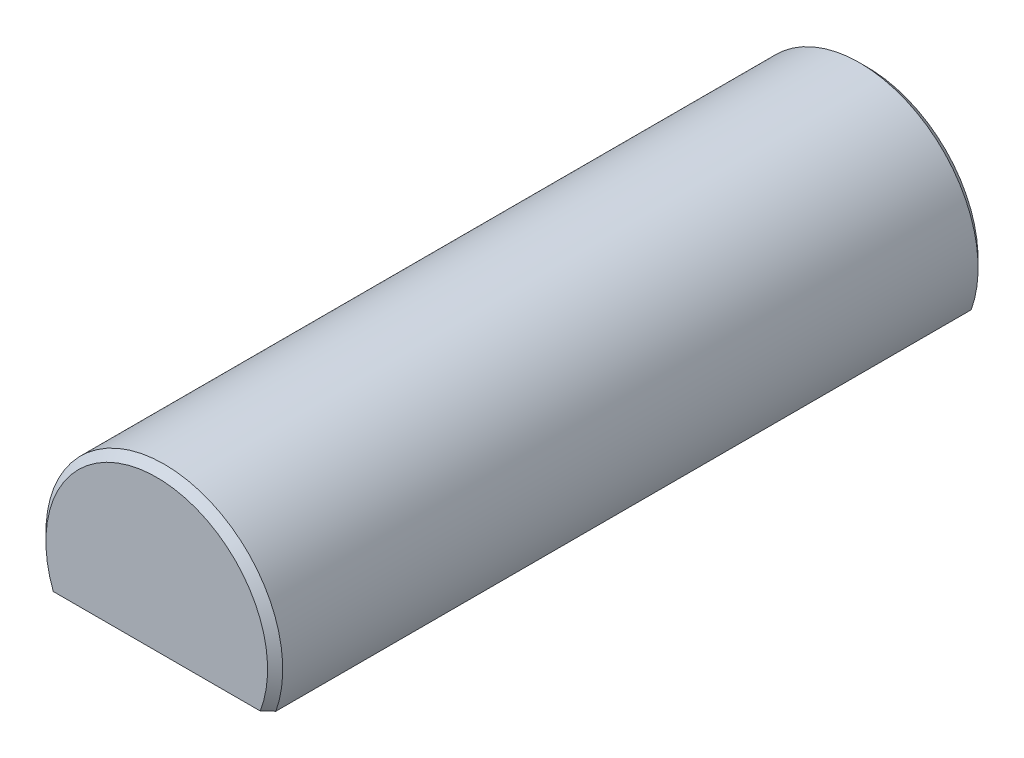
ISO-10303-21;
HEADER;
FILE_DESCRIPTION(('STEP AP214'),'2;1');
FILE_NAME('part.step','',(''),(''),'','','');
FILE_SCHEMA(('AUTOMOTIVE_DESIGN { 1 0 10303 214 1 1 1 1 }'));
ENDSEC;
DATA;
#1=APPLICATION_CONTEXT('core data for automotive mechanical design processes');
#2=APPLICATION_PROTOCOL_DEFINITION('international standard','automotive_design',2000,#1);
#3=PRODUCT_CONTEXT('',#1,'mechanical');
#4=PRODUCT('Part','Part','',(#3));
#5=PRODUCT_RELATED_PRODUCT_CATEGORY('part','',(#4));
#6=PRODUCT_DEFINITION_FORMATION('','',#4);
#7=PRODUCT_DEFINITION_CONTEXT('part definition',#1,'design');
#8=PRODUCT_DEFINITION('design','',#6,#7);
#9=PRODUCT_DEFINITION_SHAPE('','',#8);
#10=(LENGTH_UNIT() NAMED_UNIT(*) SI_UNIT(.MILLI.,.METRE.));
#11=(NAMED_UNIT(*) PLANE_ANGLE_UNIT() SI_UNIT($,.RADIAN.));
#12=(NAMED_UNIT(*) SI_UNIT($,.STERADIAN.) SOLID_ANGLE_UNIT());
#13=UNCERTAINTY_MEASURE_WITH_UNIT(LENGTH_MEASURE(1.E-05),#10,'distance_accuracy_value','');
#14=(GEOMETRIC_REPRESENTATION_CONTEXT(3) GLOBAL_UNCERTAINTY_ASSIGNED_CONTEXT((#13)) GLOBAL_UNIT_ASSIGNED_CONTEXT((#10,
#11,#12)) REPRESENTATION_CONTEXT('',''));
#15=CARTESIAN_POINT('',(0.,0.,0.));
#16=DIRECTION('',(0.,0.,1.));
#17=DIRECTION('',(1.,0.,0.));
#18=AXIS2_PLACEMENT_3D('',#15,#16,#17);
#19=CARTESIAN_POINT('',(0.,0.,19.05));
#20=DIRECTION('',(0.,0.,-1.));
#21=DIRECTION('',(-1.,0.,0.));
#22=AXIS2_PLACEMENT_3D('',#19,#20,#21);
#23=CYLINDRICAL_SURFACE('',#22,6.35);
#24=CARTESIAN_POINT('',(0.,0.,18.6436));
#25=DIRECTION('',(0.,0.,1.));
#26=DIRECTION('',(1.,0.,0.));
#27=AXIS2_PLACEMENT_3D('',#24,#25,#26);
#28=CIRCLE('',#27,6.35);
#29=CARTESIAN_POINT('',(-5.98082360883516,-2.1336,18.6436));
#30=VERTEX_POINT('',#29);
#31=CARTESIAN_POINT('',(5.98082360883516,-2.1336,18.6436));
#32=VERTEX_POINT('',#31);
#33=EDGE_CURVE('E205',#30,#32,#28,.F.);
#34=ORIENTED_EDGE('',*,*,#33,.T.);
#35=DIRECTION('',(0.,0.,1.));
#36=VECTOR('',#35,1.);
#37=CARTESIAN_POINT('',(5.98082360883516,-2.1336,-19.05));
#38=LINE('',#37,#36);
#39=CARTESIAN_POINT('',(5.98082360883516,-2.1336,-18.6436));
#40=VERTEX_POINT('',#39);
#41=EDGE_CURVE('E192',#40,#32,#38,.T.);
#42=ORIENTED_EDGE('',*,*,#41,.F.);
#43=CARTESIAN_POINT('',(0.,0.,-18.6436));
#44=DIRECTION('',(0.,0.,1.));
#45=DIRECTION('',(1.,0.,0.));
#46=AXIS2_PLACEMENT_3D('',#43,#44,#45);
#47=CIRCLE('',#46,6.35);
#48=CARTESIAN_POINT('',(-5.98082360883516,-2.1336,-18.6436));
#49=VERTEX_POINT('',#48);
#50=EDGE_CURVE('E289',#40,#49,#47,.T.);
#51=ORIENTED_EDGE('',*,*,#50,.T.);
#52=DIRECTION('',(0.,0.,1.));
#53=VECTOR('',#52,1.);
#54=CARTESIAN_POINT('',(-5.98082360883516,-2.1336,-19.05));
#55=LINE('',#54,#53);
#56=EDGE_CURVE('E193',#49,#30,#55,.T.);
#57=ORIENTED_EDGE('',*,*,#56,.T.);
#58=EDGE_LOOP('',(#34,#42,#51,#57));
#59=FACE_BOUND('',#58,.T.);
#60=ADVANCED_FACE('F28',(#59),#23,.T.);
#61=CARTESIAN_POINT('',(0.,0.,19.05));
#62=DIRECTION('',(0.,0.,1.));
#63=DIRECTION('',(1.,0.,0.));
#64=AXIS2_PLACEMENT_3D('',#61,#62,#63);
#65=PLANE('',#64);
#66=DIRECTION('',(-1.,0.,0.));
#67=VECTOR('',#66,1.);
#68=CARTESIAN_POINT('',(-5.98082360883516,-2.1336,19.05));
#69=LINE('',#68,#67);
#70=CARTESIAN_POINT('',(5.54744373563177,-2.1336,19.05));
#71=VERTEX_POINT('',#70);
#72=CARTESIAN_POINT('',(-5.54744373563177,-2.1336,19.05));
#73=VERTEX_POINT('',#72);
#74=EDGE_CURVE('E50',#71,#73,#69,.T.);
#75=ORIENTED_EDGE('',*,*,#74,.F.);
#76=CARTESIAN_POINT('',(0.,0.,19.05));
#77=DIRECTION('',(0.,0.,1.));
#78=DIRECTION('',(1.,0.,0.));
#79=AXIS2_PLACEMENT_3D('',#76,#77,#78);
#80=CIRCLE('',#79,5.94360000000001);
#81=EDGE_CURVE('E227',#71,#73,#80,.T.);
#82=ORIENTED_EDGE('',*,*,#81,.T.);
#83=EDGE_LOOP('',(#75,#82));
#84=FACE_BOUND('',#83,.T.);
#85=ADVANCED_FACE('F275',(#84),#65,.T.);
#86=CARTESIAN_POINT('',(0.,0.,-19.05));
#87=DIRECTION('',(0.,0.,1.));
#88=DIRECTION('',(1.,0.,0.));
#89=AXIS2_PLACEMENT_3D('',#86,#87,#88);
#90=PLANE('',#89);
#91=CARTESIAN_POINT('',(0.,0.,-19.05));
#92=DIRECTION('',(0.,0.,1.));
#93=DIRECTION('',(1.,0.,0.));
#94=AXIS2_PLACEMENT_3D('',#91,#92,#93);
#95=CIRCLE('',#94,5.94359999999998);
#96=CARTESIAN_POINT('',(-5.54744373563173,-2.1336,-19.05));
#97=VERTEX_POINT('',#96);
#98=CARTESIAN_POINT('',(5.54744373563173,-2.1336,-19.05));
#99=VERTEX_POINT('',#98);
#100=EDGE_CURVE('E290',#97,#99,#95,.F.);
#101=ORIENTED_EDGE('',*,*,#100,.T.);
#102=DIRECTION('',(-1.,0.,0.));
#103=VECTOR('',#102,1.);
#104=CARTESIAN_POINT('',(-5.98082360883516,-2.1336,-19.05));
#105=LINE('',#104,#103);
#106=EDGE_CURVE('E189',#99,#97,#105,.T.);
#107=ORIENTED_EDGE('',*,*,#106,.T.);
#108=EDGE_LOOP('',(#101,#107));
#109=FACE_BOUND('',#108,.T.);
#110=ADVANCED_FACE('F280',(#109),#90,.F.);
#111=CARTESIAN_POINT('',(0.,0.,-18.6436));
#112=DIRECTION('',(0.,0.,1.));
#113=DIRECTION('',(1.,0.,0.));
#114=AXIS2_PLACEMENT_3D('',#111,#112,#113);
#115=CONICAL_SURFACE('',#114,6.35,0.785398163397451);
#116=CARTESIAN_POINT('',(-13.1621530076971,-2.1336,-11.6596388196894));
#117=CARTESIAN_POINT('',(-12.7859509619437,-2.1336,-12.0309738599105));
#118=CARTESIAN_POINT('',(-12.4095634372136,-2.1336,-12.4021215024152));
#119=CARTESIAN_POINT('',(-11.655978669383,-2.1336,-13.1441433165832));
#120=CARTESIAN_POINT('',(-11.2787810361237,-2.1336,-13.515017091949));
#121=CARTESIAN_POINT('',(-10.5186277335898,-2.1336,-14.2610139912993));
#122=CARTESIAN_POINT('',(-10.1356626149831,-2.1336,-14.6361274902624));
#123=CARTESIAN_POINT('',(-9.36901491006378,-2.1336,-15.3850653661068));
#124=CARTESIAN_POINT('',(-8.98533304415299,-2.1336,-15.7588904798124));
#125=CARTESIAN_POINT('',(-8.32283503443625,-2.1336,-16.4018963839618));
#126=CARTESIAN_POINT('',(-8.04436003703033,-2.1336,-16.6714285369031));
#127=CARTESIAN_POINT('',(-7.48638168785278,-2.1336,-17.2094703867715));
#128=CARTESIAN_POINT('',(-7.20687825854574,-2.1336,-17.4779800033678));
#129=CARTESIAN_POINT('',(-6.64575887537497,-2.1336,-18.0142363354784));
#130=CARTESIAN_POINT('',(-6.36413933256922,-2.1336,-18.2819792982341));
#131=CARTESIAN_POINT('',(-5.79898542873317,-2.1336,-18.8152788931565));
#132=CARTESIAN_POINT('',(-5.51545164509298,-2.1336,-19.0808361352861));
#133=CARTESIAN_POINT('',(-5.0894176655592,-2.1336,-19.4753008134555));
#134=CARTESIAN_POINT('',(-4.94806003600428,-2.1336,-19.6054416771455));
#135=CARTESIAN_POINT('',(-4.66440861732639,-2.1336,-19.8646983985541));
#136=CARTESIAN_POINT('',(-4.52211483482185,-2.1336,-19.993814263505));
#137=CARTESIAN_POINT('',(-4.23617169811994,-2.1336,-20.2508717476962));
#138=CARTESIAN_POINT('',(-4.09252096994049,-2.1336,-20.3788118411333));
#139=CARTESIAN_POINT('',(-3.80367847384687,-2.1336,-20.6329237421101));
#140=CARTESIAN_POINT('',(-3.65848681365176,-2.1336,-20.7590956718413));
#141=CARTESIAN_POINT('',(-3.36673838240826,-2.1336,-21.0084458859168));
#142=CARTESIAN_POINT('',(-3.22019137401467,-2.1336,-21.1316355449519));
#143=CARTESIAN_POINT('',(-2.92433886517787,-2.1336,-21.3746388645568));
#144=CARTESIAN_POINT('',(-2.77503362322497,-2.1336,-21.4944528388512));
#145=CARTESIAN_POINT('',(-2.47281836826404,-2.1336,-21.7289504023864));
#146=CARTESIAN_POINT('',(-2.31991522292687,-2.1336,-21.8436427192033));
#147=CARTESIAN_POINT('',(-2.08647427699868,-2.1336,-22.0098638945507));
#148=CARTESIAN_POINT('',(-2.0080006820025,-2.1336,-22.064287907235));
#149=CARTESIAN_POINT('',(-1.84939317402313,-2.1336,-22.1706531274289));
#150=CARTESIAN_POINT('',(-1.7692595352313,-2.1336,-22.2225947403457));
#151=CARTESIAN_POINT('',(-1.64970329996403,-2.1336,-22.2967747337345));
#152=CARTESIAN_POINT('',(-1.61105163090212,-2.1336,-22.320258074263));
#153=CARTESIAN_POINT('',(-1.53325451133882,-2.1336,-22.3664082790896));
#154=CARTESIAN_POINT('',(-1.49410898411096,-2.1336,-22.389075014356));
#155=CARTESIAN_POINT('',(-1.41528678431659,-2.1336,-22.433477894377));
#156=CARTESIAN_POINT('',(-1.37561005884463,-2.1336,-22.4552139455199));
#157=CARTESIAN_POINT('',(-1.29569233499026,-2.1336,-22.4976189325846));
#158=CARTESIAN_POINT('',(-1.25545134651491,-2.1336,-22.5182878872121));
#159=CARTESIAN_POINT('',(-1.13450701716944,-2.1336,-22.5781362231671));
#160=CARTESIAN_POINT('',(-1.05290967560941,-2.1336,-22.6155414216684));
#161=CARTESIAN_POINT('',(-0.887121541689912,-2.1336,-22.6841521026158));
#162=CARTESIAN_POINT('',(-0.802931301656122,-2.1336,-22.7153588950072));
#163=CARTESIAN_POINT('',(-0.655619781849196,-2.1336,-22.7623107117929));
#164=CARTESIAN_POINT('',(-0.593103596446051,-2.1336,-22.7799454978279));
#165=CARTESIAN_POINT('',(-0.466901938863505,-2.1336,-22.8103683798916));
#166=CARTESIAN_POINT('',(-0.403216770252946,-2.1336,-22.8231577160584));
#167=CARTESIAN_POINT('',(-0.275160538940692,-2.1336,-22.8432562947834));
#168=CARTESIAN_POINT('',(-0.210791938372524,-2.1336,-22.8505810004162));
#169=CARTESIAN_POINT('',(-0.0816493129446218,-2.1336,-22.8594098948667));
#170=CARTESIAN_POINT('',(-0.0168752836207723,-2.1336,-22.8609140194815));
#171=CARTESIAN_POINT('',(0.112640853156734,-2.1336,-22.8580115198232));
#172=CARTESIAN_POINT('',(0.17738274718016,-2.1336,-22.8535955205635));
#173=CARTESIAN_POINT('',(0.306220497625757,-2.1336,-22.8390884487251));
#174=CARTESIAN_POINT('',(0.370316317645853,-2.1336,-22.8289970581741));
#175=CARTESIAN_POINT('',(0.497661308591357,-2.1336,-22.8036213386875));
#176=CARTESIAN_POINT('',(0.560907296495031,-2.1336,-22.7883212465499));
#177=CARTESIAN_POINT('',(0.686114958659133,-2.1336,-22.7531999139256));
#178=CARTESIAN_POINT('',(0.748076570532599,-2.1336,-22.733378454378));
#179=CARTESIAN_POINT('',(0.951361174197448,-2.1336,-22.661290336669));
#180=CARTESIAN_POINT('',(1.08972234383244,-2.1336,-22.6006755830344));
#181=CARTESIAN_POINT('',(1.35988965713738,-2.1336,-22.4661997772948));
#182=CARTESIAN_POINT('',(1.49168131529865,-2.1336,-22.3923109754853));
#183=CARTESIAN_POINT('',(1.68594958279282,-2.1336,-22.2747713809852));
#184=CARTESIAN_POINT('',(1.75038545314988,-2.1336,-22.2342990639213));
#185=CARTESIAN_POINT('',(1.87810330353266,-2.1336,-22.1515683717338));
#186=CARTESIAN_POINT('',(1.94138525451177,-2.1336,-22.109309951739));
#187=CARTESIAN_POINT('',(2.0668844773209,-2.1336,-22.0233856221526));
#188=CARTESIAN_POINT('',(2.12910279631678,-2.1336,-21.9797212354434));
#189=CARTESIAN_POINT('',(2.25267402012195,-2.1336,-21.8911919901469));
#190=CARTESIAN_POINT('',(2.31402695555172,-2.1336,-21.8463271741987));
#191=CARTESIAN_POINT('',(2.50964696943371,-2.1336,-21.7008138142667));
#192=CARTESIAN_POINT('',(2.64247985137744,-2.1336,-21.5982372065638));
#193=CARTESIAN_POINT('',(2.90550300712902,-2.1336,-21.3897407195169));
#194=CARTESIAN_POINT('',(3.0356928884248,-2.1336,-21.2838203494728));
#195=CARTESIAN_POINT('',(3.29413032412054,-2.1336,-21.0695301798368));
#196=CARTESIAN_POINT('',(3.42237702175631,-2.1336,-20.9611593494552));
#197=CARTESIAN_POINT('',(3.67733774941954,-2.1336,-20.7426267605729));
#198=CARTESIAN_POINT('',(3.80405172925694,-2.1336,-20.6324649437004));
#199=CARTESIAN_POINT('',(4.18282023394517,-2.1336,-20.2996067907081));
#200=CARTESIAN_POINT('',(4.43309104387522,-2.1336,-20.0748830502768));
#201=CARTESIAN_POINT('',(4.93054449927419,-2.1336,-19.6221922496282));
#202=CARTESIAN_POINT('',(5.17772792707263,-2.1336,-19.3942260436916));
#203=CARTESIAN_POINT('',(5.66907719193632,-2.1336,-18.9369807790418));
#204=CARTESIAN_POINT('',(5.91325104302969,-2.1336,-18.7077103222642));
#205=CARTESIAN_POINT('',(6.40017148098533,-2.1336,-18.2476298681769));
#206=CARTESIAN_POINT('',(6.64291797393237,-2.1336,-18.0168197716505));
#207=CARTESIAN_POINT('',(7.127146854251,-2.1336,-17.5542891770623));
#208=CARTESIAN_POINT('',(7.3686301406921,-2.1336,-17.3225696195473));
#209=CARTESIAN_POINT('',(7.85079908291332,-2.1336,-16.8583018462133));
#210=CARTESIAN_POINT('',(8.09148473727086,-2.1336,-16.6257536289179));
#211=CARTESIAN_POINT('',(8.73636525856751,-2.1336,-16.0010366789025));
#212=CARTESIAN_POINT('',(9.13999994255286,-2.1336,-15.6082898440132));
#213=CARTESIAN_POINT('',(9.9462068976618,-2.1336,-14.8215001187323));
#214=CARTESIAN_POINT('',(10.3487788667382,-2.1336,-14.4274569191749));
#215=CARTESIAN_POINT('',(11.1535507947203,-2.1336,-13.6380830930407));
#216=CARTESIAN_POINT('',(11.555749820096,-2.1336,-13.2427515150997));
#217=CARTESIAN_POINT('',(12.3594192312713,-2.1336,-12.4515625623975));
#218=CARTESIAN_POINT('',(12.7608897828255,-2.1336,-12.0557053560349));
#219=CARTESIAN_POINT('',(13.1621530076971,-2.1336,-11.6596388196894));
#220=B_SPLINE_CURVE_WITH_KNOTS('',3,(#116,#117,#118,#119,#120,#121,#122,#123,#124,#125,#126,
#127,#128,#129,#130,#131,#132,#133,#134,#135,#136,#137,#138,#139,#140,#141,#142,#143,#144,#145,
#146,#147,#148,#149,#150,#151,#152,#153,#154,#155,#156,#157,#158,#159,#160,#161,#162,#163,#164,
#165,#166,#167,#168,#169,#170,#171,#172,#173,#174,#175,#176,#177,#178,#179,#180,#181,#182,#183,
#184,#185,#186,#187,#188,#189,#190,#191,#192,#193,#194,#195,#196,#197,#198,#199,#200,#201,#202,
#203,#204,#205,#206,#207,#208,#209,#210,#211,#212,#213,#214,#215,#216,#217,#218,#219),
.UNSPECIFIED.,.F.,.F.,(4,2,2,2,2,2,2,2,2,2,2,2,2,2,2,2,2,2,2,2,2,2,2,2,2,2,2,2,2,2,2,2,2,2,2,2,
2,2,2,2,2,2,2,2,2,2,2,2,2,2,2,4),(0.,1.58579972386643,3.17275490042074,4.78096751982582,
6.38801552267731,7.55066718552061,8.71340837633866,9.87914790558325,11.0445502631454,
11.6209731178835,12.1973919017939,12.7744753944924,13.3515188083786,13.9258207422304,
14.5000691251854,15.0732983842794,15.3597629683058,15.6461806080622,15.7818514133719,
15.9175435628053,16.0532493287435,16.1889527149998,16.4580387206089,16.727067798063,
16.9217723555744,17.1164270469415,17.3105288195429,17.5046327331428,17.6990443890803,
17.8934669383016,18.0884831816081,18.2835088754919,18.7354043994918,19.1882558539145,
19.4165066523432,19.6447631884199,19.8727802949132,20.1007893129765,20.6041858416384,
21.1076565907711,21.6113432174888,22.1150462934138,23.1240607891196,24.1328141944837,
25.1376287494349,26.1425086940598,27.1465345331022,28.1505621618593,29.8400961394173,
31.5300674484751,33.2219472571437,34.9133757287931),.UNSPECIFIED.);
#221=EDGE_CURVE('E204',#49,#97,#220,.T.);
#222=ORIENTED_EDGE('',*,*,#221,.F.);
#223=ORIENTED_EDGE('',*,*,#50,.F.);
#224=EDGE_CURVE('E196',#99,#40,#220,.T.);
#225=ORIENTED_EDGE('',*,*,#224,.F.);
#226=ORIENTED_EDGE('',*,*,#100,.F.);
#227=EDGE_LOOP('',(#222,#223,#225,#226));
#228=FACE_BOUND('',#227,.T.);
#229=ADVANCED_FACE('F207',(#228),#115,.T.);
#230=CARTESIAN_POINT('',(0.,0.,19.05));
#231=DIRECTION('',(0.,0.,-1.));
#232=DIRECTION('',(-1.,0.,0.));
#233=AXIS2_PLACEMENT_3D('',#230,#231,#232);
#234=CONICAL_SURFACE('',#233,5.94360000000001,0.785398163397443);
#235=CARTESIAN_POINT('',(13.1621530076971,-2.1336,11.6596388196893));
#236=CARTESIAN_POINT('',(12.7859509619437,-2.1336,12.0309738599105));
#237=CARTESIAN_POINT('',(12.4095634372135,-2.1336,12.4021215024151));
#238=CARTESIAN_POINT('',(11.655978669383,-2.1336,13.1441433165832));
#239=CARTESIAN_POINT('',(11.2787810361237,-2.1336,13.515017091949));
#240=CARTESIAN_POINT('',(10.5186277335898,-2.1336,14.2610139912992));
#241=CARTESIAN_POINT('',(10.1356626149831,-2.1336,14.6361274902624));
#242=CARTESIAN_POINT('',(9.36901491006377,-2.1336,15.3850653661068));
#243=CARTESIAN_POINT('',(8.98533304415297,-2.1336,15.7588904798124));
#244=CARTESIAN_POINT('',(8.32283503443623,-2.1336,16.4018963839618));
#245=CARTESIAN_POINT('',(8.04436003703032,-2.1336,16.6714285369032));
#246=CARTESIAN_POINT('',(7.48638168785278,-2.1336,17.2094703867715));
#247=CARTESIAN_POINT('',(7.20687825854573,-2.1336,17.4779800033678));
#248=CARTESIAN_POINT('',(6.64575887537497,-2.1336,18.0142363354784));
#249=CARTESIAN_POINT('',(6.36413933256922,-2.1336,18.2819792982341));
#250=CARTESIAN_POINT('',(5.79898542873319,-2.1336,18.8152788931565));
#251=CARTESIAN_POINT('',(5.51545164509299,-2.1336,19.0808361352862));
#252=CARTESIAN_POINT('',(5.08941766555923,-2.1336,19.4753008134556));
#253=CARTESIAN_POINT('',(4.9480600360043,-2.1336,19.6054416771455));
#254=CARTESIAN_POINT('',(4.66440861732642,-2.1336,19.8646983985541));
#255=CARTESIAN_POINT('',(4.52211483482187,-2.1336,19.993814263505));
#256=CARTESIAN_POINT('',(4.23617169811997,-2.1336,20.2508717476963));
#257=CARTESIAN_POINT('',(4.09252096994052,-2.1336,20.3788118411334));
#258=CARTESIAN_POINT('',(3.8036784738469,-2.1336,20.6329237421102));
#259=CARTESIAN_POINT('',(3.65848681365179,-2.1336,20.7590956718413));
#260=CARTESIAN_POINT('',(3.3667383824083,-2.1336,21.0084458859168));
#261=CARTESIAN_POINT('',(3.22019137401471,-2.1336,21.1316355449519));
#262=CARTESIAN_POINT('',(2.92433886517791,-2.1336,21.3746388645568));
#263=CARTESIAN_POINT('',(2.77503362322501,-2.1336,21.4944528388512));
#264=CARTESIAN_POINT('',(2.47281836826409,-2.1336,21.7289504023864));
#265=CARTESIAN_POINT('',(2.31991522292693,-2.1336,21.8436427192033));
#266=CARTESIAN_POINT('',(2.08647427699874,-2.1336,22.0098638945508));
#267=CARTESIAN_POINT('',(2.00800068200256,-2.1336,22.064287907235));
#268=CARTESIAN_POINT('',(1.84939317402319,-2.1336,22.1706531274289));
#269=CARTESIAN_POINT('',(1.76925953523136,-2.1336,22.2225947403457));
#270=CARTESIAN_POINT('',(1.64970329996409,-2.1336,22.2967747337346));
#271=CARTESIAN_POINT('',(1.61105163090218,-2.1336,22.3202580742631));
#272=CARTESIAN_POINT('',(1.53325451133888,-2.1336,22.3664082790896));
#273=CARTESIAN_POINT('',(1.49410898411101,-2.1336,22.3890750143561));
#274=CARTESIAN_POINT('',(1.41528678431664,-2.1336,22.4334778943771));
#275=CARTESIAN_POINT('',(1.37561005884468,-2.1336,22.45521394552));
#276=CARTESIAN_POINT('',(1.29569233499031,-2.1336,22.4976189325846));
#277=CARTESIAN_POINT('',(1.25545134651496,-2.1336,22.5182878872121));
#278=CARTESIAN_POINT('',(1.13450701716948,-2.1336,22.5781362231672));
#279=CARTESIAN_POINT('',(1.05290967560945,-2.1336,22.6155414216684));
#280=CARTESIAN_POINT('',(0.887121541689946,-2.1336,22.6841521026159));
#281=CARTESIAN_POINT('',(0.802931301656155,-2.1336,22.7153588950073));
#282=CARTESIAN_POINT('',(0.655619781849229,-2.1336,22.7623107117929));
#283=CARTESIAN_POINT('',(0.593103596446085,-2.1336,22.779945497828));
#284=CARTESIAN_POINT('',(0.466901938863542,-2.1336,22.8103683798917));
#285=CARTESIAN_POINT('',(0.403216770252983,-2.1336,22.8231577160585));
#286=CARTESIAN_POINT('',(0.27516053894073,-2.1336,22.8432562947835));
#287=CARTESIAN_POINT('',(0.210791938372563,-2.1336,22.8505810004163));
#288=CARTESIAN_POINT('',(0.0816493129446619,-2.1336,22.8594098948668));
#289=CARTESIAN_POINT('',(0.0168752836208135,-2.1336,22.8609140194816));
#290=CARTESIAN_POINT('',(-0.11264085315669,-2.1336,22.8580115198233));
#291=CARTESIAN_POINT('',(-0.177382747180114,-2.1336,22.8535955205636));
#292=CARTESIAN_POINT('',(-0.306220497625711,-2.1336,22.8390884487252));
#293=CARTESIAN_POINT('',(-0.370316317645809,-2.1336,22.8289970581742));
#294=CARTESIAN_POINT('',(-0.497661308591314,-2.1336,22.8036213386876));
#295=CARTESIAN_POINT('',(-0.560907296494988,-2.1336,22.78832124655));
#296=CARTESIAN_POINT('',(-0.686114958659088,-2.1336,22.7531999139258));
#297=CARTESIAN_POINT('',(-0.748076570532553,-2.1336,22.7333784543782));
#298=CARTESIAN_POINT('',(-0.951361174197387,-2.1336,22.6612903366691));
#299=CARTESIAN_POINT('',(-1.08972234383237,-2.1336,22.6006755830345));
#300=CARTESIAN_POINT('',(-1.35988965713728,-2.1336,22.4661997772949));
#301=CARTESIAN_POINT('',(-1.49168131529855,-2.1336,22.3923109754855));
#302=CARTESIAN_POINT('',(-1.68594958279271,-2.1336,22.2747713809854));
#303=CARTESIAN_POINT('',(-1.75038545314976,-2.1336,22.2342990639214));
#304=CARTESIAN_POINT('',(-1.87810330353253,-2.1336,22.151568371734));
#305=CARTESIAN_POINT('',(-1.94138525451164,-2.1336,22.1093099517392));
#306=CARTESIAN_POINT('',(-2.06688447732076,-2.1336,22.0233856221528));
#307=CARTESIAN_POINT('',(-2.12910279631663,-2.1336,21.9797212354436));
#308=CARTESIAN_POINT('',(-2.25267402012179,-2.1336,21.8911919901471));
#309=CARTESIAN_POINT('',(-2.31402695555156,-2.1336,21.846327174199));
#310=CARTESIAN_POINT('',(-2.50964696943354,-2.1336,21.7008138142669));
#311=CARTESIAN_POINT('',(-2.64247985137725,-2.1336,21.5982372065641));
#312=CARTESIAN_POINT('',(-2.90550300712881,-2.1336,21.3897407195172));
#313=CARTESIAN_POINT('',(-3.03569288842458,-2.1336,21.283820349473));
#314=CARTESIAN_POINT('',(-3.29413032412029,-2.1336,21.0695301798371));
#315=CARTESIAN_POINT('',(-3.42237702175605,-2.1336,20.9611593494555));
#316=CARTESIAN_POINT('',(-3.67733774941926,-2.1336,20.7426267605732));
#317=CARTESIAN_POINT('',(-3.80405172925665,-2.1336,20.6324649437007));
#318=CARTESIAN_POINT('',(-4.18282023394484,-2.1336,20.2996067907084));
#319=CARTESIAN_POINT('',(-4.43309104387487,-2.1336,20.0748830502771));
#320=CARTESIAN_POINT('',(-4.9305444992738,-2.1336,19.6221922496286));
#321=CARTESIAN_POINT('',(-5.17772792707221,-2.1336,19.394226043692));
#322=CARTESIAN_POINT('',(-5.66907719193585,-2.1336,18.9369807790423));
#323=CARTESIAN_POINT('',(-5.9132510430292,-2.1336,18.7077103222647));
#324=CARTESIAN_POINT('',(-6.40017148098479,-2.1336,18.2476298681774));
#325=CARTESIAN_POINT('',(-6.64291797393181,-2.1336,18.016819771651));
#326=CARTESIAN_POINT('',(-7.1271468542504,-2.1336,17.5542891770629));
#327=CARTESIAN_POINT('',(-7.36863014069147,-2.1336,17.3225696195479));
#328=CARTESIAN_POINT('',(-7.85079908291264,-2.1336,16.8583018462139));
#329=CARTESIAN_POINT('',(-8.09148473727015,-2.1336,16.6257536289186));
#330=CARTESIAN_POINT('',(-8.73636525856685,-2.1336,16.0010366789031));
#331=CARTESIAN_POINT('',(-9.13999994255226,-2.1336,15.6082898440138));
#332=CARTESIAN_POINT('',(-9.94620689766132,-2.1336,14.8215001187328));
#333=CARTESIAN_POINT('',(-10.3487788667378,-2.1336,14.4274569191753));
#334=CARTESIAN_POINT('',(-11.15355079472,-2.1336,13.638083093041));
#335=CARTESIAN_POINT('',(-11.5557498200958,-2.1336,13.2427515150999));
#336=CARTESIAN_POINT('',(-12.3594192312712,-2.1336,12.4515625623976));
#337=CARTESIAN_POINT('',(-12.7608897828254,-2.1336,12.0557053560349));
#338=CARTESIAN_POINT('',(-13.1621530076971,-2.1336,11.6596388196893));
#339=B_SPLINE_CURVE_WITH_KNOTS('',3,(#235,#236,#237,#238,#239,#240,#241,#242,#243,#244,#245,
#246,#247,#248,#249,#250,#251,#252,#253,#254,#255,#256,#257,#258,#259,#260,#261,#262,#263,#264,
#265,#266,#267,#268,#269,#270,#271,#272,#273,#274,#275,#276,#277,#278,#279,#280,#281,#282,#283,
#284,#285,#286,#287,#288,#289,#290,#291,#292,#293,#294,#295,#296,#297,#298,#299,#300,#301,#302,
#303,#304,#305,#306,#307,#308,#309,#310,#311,#312,#313,#314,#315,#316,#317,#318,#319,#320,#321,
#322,#323,#324,#325,#326,#327,#328,#329,#330,#331,#332,#333,#334,#335,#336,#337,#338),
.UNSPECIFIED.,.F.,.F.,(4,2,2,2,2,2,2,2,2,2,2,2,2,2,2,2,2,2,2,2,2,2,2,2,2,2,2,2,2,2,2,2,2,2,2,2,
2,2,2,2,2,2,2,2,2,2,2,2,2,2,2,4),(0.,1.58579972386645,3.17275490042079,4.78096751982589,
6.3880155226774,7.55066718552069,8.71340837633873,9.87914790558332,11.0445502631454,
11.6209731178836,12.197391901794,12.7744753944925,13.3515188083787,13.9258207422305,
14.5000691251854,15.0732983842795,15.3597629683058,15.6461806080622,15.7818514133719,
15.9175435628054,16.0532493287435,16.1889527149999,16.458038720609,16.727067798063,
16.9217723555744,17.1164270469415,17.310528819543,17.5046327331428,17.6990443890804,
17.8934669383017,18.0884831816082,18.283508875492,18.7354043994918,19.1882558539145,
19.4165066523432,19.6447631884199,19.8727802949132,20.1007893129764,20.6041858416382,
21.107656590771,21.6113432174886,22.1150462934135,23.1240607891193,24.1328141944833,
25.1376287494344,26.1425086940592,27.1465345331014,28.1505621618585,29.8400961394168,
31.5300674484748,33.2219472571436,34.9133757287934),.UNSPECIFIED.);
#340=EDGE_CURVE('E226',#32,#71,#339,.T.);
#341=ORIENTED_EDGE('',*,*,#340,.F.);
#342=ORIENTED_EDGE('',*,*,#33,.F.);
#343=EDGE_CURVE('E220',#73,#30,#339,.T.);
#344=ORIENTED_EDGE('',*,*,#343,.F.);
#345=ORIENTED_EDGE('',*,*,#81,.F.);
#346=EDGE_LOOP('',(#341,#342,#344,#345));
#347=FACE_BOUND('',#346,.T.);
#348=ADVANCED_FACE('F215',(#347),#234,.T.);
#349=CARTESIAN_POINT('',(-5.98082360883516,-2.1336,-19.05));
#350=DIRECTION('',(0.,1.,0.));
#351=DIRECTION('',(0.,0.,1.));
#352=AXIS2_PLACEMENT_3D('',#349,#350,#351);
#353=PLANE('',#352);
#354=DIRECTION('',(0.,0.,-1.));
#355=VECTOR('',#354,1.);
#356=CARTESIAN_POINT('',(-4.39332360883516,-2.1336,16.9545));
#357=LINE('',#356,#355);
#358=CARTESIAN_POINT('',(-4.39332360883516,-2.1336,16.9545));
#359=VERTEX_POINT('',#358);
#360=CARTESIAN_POINT('',(-4.39332360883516,-2.1336,-16.9545));
#361=VERTEX_POINT('',#360);
#362=EDGE_CURVE('E131',#359,#361,#357,.T.);
#363=ORIENTED_EDGE('',*,*,#362,.F.);
#364=CARTESIAN_POINT('',(-3.88532360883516,-2.1336,16.9545));
#365=DIRECTION('',(0.,-1.,0.));
#366=DIRECTION('',(0.,0.,-1.));
#367=AXIS2_PLACEMENT_3D('',#364,#365,#366);
#368=CIRCLE('',#367,0.507999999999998);
#369=CARTESIAN_POINT('',(-3.88532360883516,-2.1336,17.4625));
#370=VERTEX_POINT('',#369);
#371=EDGE_CURVE('E42',#370,#359,#368,.T.);
#372=ORIENTED_EDGE('',*,*,#371,.F.);
#373=DIRECTION('',(-1.,0.,0.));
#374=VECTOR('',#373,1.);
#375=CARTESIAN_POINT('',(3.88532360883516,-2.1336,17.4625));
#376=LINE('',#375,#374);
#377=CARTESIAN_POINT('',(3.88532360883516,-2.1336,17.4625));
#378=VERTEX_POINT('',#377);
#379=EDGE_CURVE('E152',#378,#370,#376,.T.);
#380=ORIENTED_EDGE('',*,*,#379,.F.);
#381=CARTESIAN_POINT('',(3.88532360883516,-2.1336,16.9545));
#382=DIRECTION('',(0.,-1.,0.));
#383=DIRECTION('',(0.,0.,1.));
#384=AXIS2_PLACEMENT_3D('',#381,#382,#383);
#385=CIRCLE('',#384,0.507999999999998);
#386=CARTESIAN_POINT('',(4.39332360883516,-2.1336,16.9545));
#387=VERTEX_POINT('',#386);
#388=EDGE_CURVE('E149',#387,#378,#385,.T.);
#389=ORIENTED_EDGE('',*,*,#388,.F.);
#390=DIRECTION('',(0.,0.,1.));
#391=VECTOR('',#390,1.);
#392=CARTESIAN_POINT('',(4.39332360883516,-2.1336,16.9545));
#393=LINE('',#392,#391);
#394=CARTESIAN_POINT('',(4.39332360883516,-2.1336,-16.9545));
#395=VERTEX_POINT('',#394);
#396=EDGE_CURVE('E146',#395,#387,#393,.T.);
#397=ORIENTED_EDGE('',*,*,#396,.F.);
#398=CARTESIAN_POINT('',(3.88532360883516,-2.1336,-16.9545));
#399=DIRECTION('',(0.,-1.,0.));
#400=DIRECTION('',(0.,0.,1.));
#401=AXIS2_PLACEMENT_3D('',#398,#399,#400);
#402=CIRCLE('',#401,0.507999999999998);
#403=CARTESIAN_POINT('',(3.88532360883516,-2.1336,-17.4625));
#404=VERTEX_POINT('',#403);
#405=EDGE_CURVE('E140',#404,#395,#402,.T.);
#406=ORIENTED_EDGE('',*,*,#405,.F.);
#407=DIRECTION('',(1.,0.,0.));
#408=VECTOR('',#407,1.);
#409=CARTESIAN_POINT('',(3.88532360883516,-2.1336,-17.4625));
#410=LINE('',#409,#408);
#411=CARTESIAN_POINT('',(-3.88532360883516,-2.1336,-17.4625));
#412=VERTEX_POINT('',#411);
#413=EDGE_CURVE('E138',#412,#404,#410,.T.);
#414=ORIENTED_EDGE('',*,*,#413,.F.);
#415=CARTESIAN_POINT('',(-3.88532360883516,-2.1336,-16.9545));
#416=DIRECTION('',(0.,-1.,0.));
#417=DIRECTION('',(0.,0.,1.));
#418=AXIS2_PLACEMENT_3D('',#415,#416,#417);
#419=CIRCLE('',#418,0.507999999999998);
#420=EDGE_CURVE('E120',#361,#412,#419,.T.);
#421=ORIENTED_EDGE('',*,*,#420,.F.);
#422=EDGE_LOOP('',(#363,#372,#380,#389,#397,#406,#414,#421));
#423=FACE_BOUND('',#422,.T.);
#424=ORIENTED_EDGE('',*,*,#221,.T.);
#425=ORIENTED_EDGE('',*,*,#106,.F.);
#426=ORIENTED_EDGE('',*,*,#224,.T.);
#427=ORIENTED_EDGE('',*,*,#41,.T.);
#428=ORIENTED_EDGE('',*,*,#340,.T.);
#429=ORIENTED_EDGE('',*,*,#74,.T.);
#430=ORIENTED_EDGE('',*,*,#343,.T.);
#431=ORIENTED_EDGE('',*,*,#56,.F.);
#432=EDGE_LOOP('',(#424,#425,#426,#427,#428,#429,#430,#431));
#433=FACE_BOUND('',#432,.T.);
#434=ADVANCED_FACE('F135',(#423,#433),#353,.F.);
#435=CARTESIAN_POINT('',(-3.88532360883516,-2.0066,16.9545));
#436=DIRECTION('',(0.,-1.,0.));
#437=DIRECTION('',(0.,0.,-1.));
#438=AXIS2_PLACEMENT_3D('',#435,#436,#437);
#439=CYLINDRICAL_SURFACE('',#438,0.507999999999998);
#440=ORIENTED_EDGE('',*,*,#371,.T.);
#441=DIRECTION('',(0.,-1.,0.));
#442=VECTOR('',#441,1.);
#443=CARTESIAN_POINT('',(-4.39332360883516,-2.0066,16.9545));
#444=LINE('',#443,#442);
#445=CARTESIAN_POINT('',(-4.39332360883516,-2.0066,16.9545));
#446=VERTEX_POINT('',#445);
#447=EDGE_CURVE('E128',#446,#359,#444,.T.);
#448=ORIENTED_EDGE('',*,*,#447,.F.);
#449=CARTESIAN_POINT('',(-3.88532360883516,-2.0066,16.9545));
#450=DIRECTION('',(0.,-1.,0.));
#451=DIRECTION('',(0.,0.,-1.));
#452=AXIS2_PLACEMENT_3D('',#449,#450,#451);
#453=CIRCLE('',#452,0.507999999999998);
#454=CARTESIAN_POINT('',(-3.88532360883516,-2.0066,17.4625));
#455=VERTEX_POINT('',#454);
#456=EDGE_CURVE('E155',#455,#446,#453,.T.);
#457=ORIENTED_EDGE('',*,*,#456,.F.);
#458=DIRECTION('',(0.,-1.,0.));
#459=VECTOR('',#458,1.);
#460=CARTESIAN_POINT('',(-3.88532360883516,-2.0066,17.4625));
#461=LINE('',#460,#459);
#462=EDGE_CURVE('E176',#455,#370,#461,.T.);
#463=ORIENTED_EDGE('',*,*,#462,.T.);
#464=EDGE_LOOP('',(#440,#448,#457,#463));
#465=FACE_BOUND('',#464,.T.);
#466=ADVANCED_FACE('F214',(#465),#439,.F.);
#467=CARTESIAN_POINT('',(3.88532360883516,-2.0066,17.4625));
#468=DIRECTION('',(0.,0.,1.));
#469=DIRECTION('',(1.,0.,0.));
#470=AXIS2_PLACEMENT_3D('',#467,#468,#469);
#471=PLANE('',#470);
#472=ORIENTED_EDGE('',*,*,#379,.T.);
#473=ORIENTED_EDGE('',*,*,#462,.F.);
#474=DIRECTION('',(-1.,0.,0.));
#475=VECTOR('',#474,1.);
#476=CARTESIAN_POINT('',(3.88532360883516,-2.0066,17.4625));
#477=LINE('',#476,#475);
#478=CARTESIAN_POINT('',(3.88532360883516,-2.0066,17.4625));
#479=VERTEX_POINT('',#478);
#480=EDGE_CURVE('E173',#479,#455,#477,.T.);
#481=ORIENTED_EDGE('',*,*,#480,.F.);
#482=DIRECTION('',(0.,-1.,0.));
#483=VECTOR('',#482,1.);
#484=CARTESIAN_POINT('',(3.88532360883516,-2.0066,17.4625));
#485=LINE('',#484,#483);
#486=EDGE_CURVE('E178',#479,#378,#485,.T.);
#487=ORIENTED_EDGE('',*,*,#486,.T.);
#488=EDGE_LOOP('',(#472,#473,#481,#487));
#489=FACE_BOUND('',#488,.T.);
#490=ADVANCED_FACE('F329',(#489),#471,.F.);
#491=CARTESIAN_POINT('',(3.88532360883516,-2.0066,16.9545));
#492=DIRECTION('',(0.,-1.,0.));
#493=DIRECTION('',(0.,0.,-1.));
#494=AXIS2_PLACEMENT_3D('',#491,#492,#493);
#495=CYLINDRICAL_SURFACE('',#494,0.507999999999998);
#496=ORIENTED_EDGE('',*,*,#388,.T.);
#497=ORIENTED_EDGE('',*,*,#486,.F.);
#498=CARTESIAN_POINT('',(3.88532360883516,-2.0066,16.9545));
#499=DIRECTION('',(0.,-1.,0.));
#500=DIRECTION('',(0.,0.,1.));
#501=AXIS2_PLACEMENT_3D('',#498,#499,#500);
#502=CIRCLE('',#501,0.507999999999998);
#503=CARTESIAN_POINT('',(4.39332360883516,-2.0066,16.9545));
#504=VERTEX_POINT('',#503);
#505=EDGE_CURVE('E170',#504,#479,#502,.T.);
#506=ORIENTED_EDGE('',*,*,#505,.F.);
#507=DIRECTION('',(0.,-1.,0.));
#508=VECTOR('',#507,1.);
#509=CARTESIAN_POINT('',(4.39332360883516,-2.0066,16.9545));
#510=LINE('',#509,#508);
#511=EDGE_CURVE('E180',#504,#387,#510,.T.);
#512=ORIENTED_EDGE('',*,*,#511,.T.);
#513=EDGE_LOOP('',(#496,#497,#506,#512));
#514=FACE_BOUND('',#513,.T.);
#515=ADVANCED_FACE('F335',(#514),#495,.F.);
#516=CARTESIAN_POINT('',(4.39332360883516,-2.0066,16.9545));
#517=DIRECTION('',(1.,0.,0.));
#518=DIRECTION('',(0.,0.,-1.));
#519=AXIS2_PLACEMENT_3D('',#516,#517,#518);
#520=PLANE('',#519);
#521=ORIENTED_EDGE('',*,*,#396,.T.);
#522=ORIENTED_EDGE('',*,*,#511,.F.);
#523=DIRECTION('',(0.,0.,1.));
#524=VECTOR('',#523,1.);
#525=CARTESIAN_POINT('',(4.39332360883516,-2.0066,16.9545));
#526=LINE('',#525,#524);
#527=CARTESIAN_POINT('',(4.39332360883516,-2.0066,-16.9545));
#528=VERTEX_POINT('',#527);
#529=EDGE_CURVE('E167',#528,#504,#526,.T.);
#530=ORIENTED_EDGE('',*,*,#529,.F.);
#531=DIRECTION('',(0.,-1.,0.));
#532=VECTOR('',#531,1.);
#533=CARTESIAN_POINT('',(4.39332360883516,-2.0066,-16.9545));
#534=LINE('',#533,#532);
#535=EDGE_CURVE('E182',#528,#395,#534,.T.);
#536=ORIENTED_EDGE('',*,*,#535,.T.);
#537=EDGE_LOOP('',(#521,#522,#530,#536));
#538=FACE_BOUND('',#537,.T.);
#539=ADVANCED_FACE('F343',(#538),#520,.F.);
#540=CARTESIAN_POINT('',(3.88532360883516,-2.0066,-16.9545));
#541=DIRECTION('',(0.,-1.,0.));
#542=DIRECTION('',(0.,0.,-1.));
#543=AXIS2_PLACEMENT_3D('',#540,#541,#542);
#544=CYLINDRICAL_SURFACE('',#543,0.507999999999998);
#545=ORIENTED_EDGE('',*,*,#405,.T.);
#546=ORIENTED_EDGE('',*,*,#535,.F.);
#547=CARTESIAN_POINT('',(3.88532360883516,-2.0066,-16.9545));
#548=DIRECTION('',(0.,-1.,0.));
#549=DIRECTION('',(0.,0.,1.));
#550=AXIS2_PLACEMENT_3D('',#547,#548,#549);
#551=CIRCLE('',#550,0.507999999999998);
#552=CARTESIAN_POINT('',(3.88532360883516,-2.0066,-17.4625));
#553=VERTEX_POINT('',#552);
#554=EDGE_CURVE('E164',#553,#528,#551,.T.);
#555=ORIENTED_EDGE('',*,*,#554,.F.);
#556=DIRECTION('',(0.,-1.,0.));
#557=VECTOR('',#556,1.);
#558=CARTESIAN_POINT('',(3.88532360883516,-2.0066,-17.4625));
#559=LINE('',#558,#557);
#560=EDGE_CURVE('E184',#553,#404,#559,.T.);
#561=ORIENTED_EDGE('',*,*,#560,.T.);
#562=EDGE_LOOP('',(#545,#546,#555,#561));
#563=FACE_BOUND('',#562,.T.);
#564=ADVANCED_FACE('F351',(#563),#544,.F.);
#565=CARTESIAN_POINT('',(3.88532360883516,-2.0066,-17.4625));
#566=DIRECTION('',(0.,0.,-1.));
#567=DIRECTION('',(-1.,0.,0.));
#568=AXIS2_PLACEMENT_3D('',#565,#566,#567);
#569=PLANE('',#568);
#570=ORIENTED_EDGE('',*,*,#413,.T.);
#571=ORIENTED_EDGE('',*,*,#560,.F.);
#572=DIRECTION('',(1.,0.,0.));
#573=VECTOR('',#572,1.);
#574=CARTESIAN_POINT('',(3.88532360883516,-2.0066,-17.4625));
#575=LINE('',#574,#573);
#576=CARTESIAN_POINT('',(-3.88532360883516,-2.0066,-17.4625));
#577=VERTEX_POINT('',#576);
#578=EDGE_CURVE('E161',#577,#553,#575,.T.);
#579=ORIENTED_EDGE('',*,*,#578,.F.);
#580=DIRECTION('',(0.,-1.,0.));
#581=VECTOR('',#580,1.);
#582=CARTESIAN_POINT('',(-3.88532360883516,-2.0066,-17.4625));
#583=LINE('',#582,#581);
#584=EDGE_CURVE('E127',#577,#412,#583,.T.);
#585=ORIENTED_EDGE('',*,*,#584,.T.);
#586=EDGE_LOOP('',(#570,#571,#579,#585));
#587=FACE_BOUND('',#586,.T.);
#588=ADVANCED_FACE('F359',(#587),#569,.F.);
#589=CARTESIAN_POINT('',(-3.88532360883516,-2.0066,-16.9545));
#590=DIRECTION('',(0.,-1.,0.));
#591=DIRECTION('',(0.,0.,-1.));
#592=AXIS2_PLACEMENT_3D('',#589,#590,#591);
#593=CYLINDRICAL_SURFACE('',#592,0.507999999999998);
#594=ORIENTED_EDGE('',*,*,#420,.T.);
#595=ORIENTED_EDGE('',*,*,#584,.F.);
#596=CARTESIAN_POINT('',(-3.88532360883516,-2.0066,-16.9545));
#597=DIRECTION('',(0.,-1.,0.));
#598=DIRECTION('',(0.,0.,1.));
#599=AXIS2_PLACEMENT_3D('',#596,#597,#598);
#600=CIRCLE('',#599,0.507999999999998);
#601=CARTESIAN_POINT('',(-4.39332360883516,-2.0066,-16.9545));
#602=VERTEX_POINT('',#601);
#603=EDGE_CURVE('E123',#602,#577,#600,.T.);
#604=ORIENTED_EDGE('',*,*,#603,.F.);
#605=DIRECTION('',(0.,-1.,0.));
#606=VECTOR('',#605,1.);
#607=CARTESIAN_POINT('',(-4.39332360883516,-2.0066,-16.9545));
#608=LINE('',#607,#606);
#609=EDGE_CURVE('E116',#602,#361,#608,.T.);
#610=ORIENTED_EDGE('',*,*,#609,.T.);
#611=EDGE_LOOP('',(#594,#595,#604,#610));
#612=FACE_BOUND('',#611,.T.);
#613=ADVANCED_FACE('F118',(#612),#593,.F.);
#614=CARTESIAN_POINT('',(-4.39332360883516,-2.0066,16.9545));
#615=DIRECTION('',(-1.,0.,0.));
#616=DIRECTION('',(0.,0.,1.));
#617=AXIS2_PLACEMENT_3D('',#614,#615,#616);
#618=PLANE('',#617);
#619=ORIENTED_EDGE('',*,*,#362,.T.);
#620=ORIENTED_EDGE('',*,*,#609,.F.);
#621=DIRECTION('',(0.,0.,-1.));
#622=VECTOR('',#621,1.);
#623=CARTESIAN_POINT('',(-4.39332360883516,-2.0066,16.9545));
#624=LINE('',#623,#622);
#625=EDGE_CURVE('E158',#446,#602,#624,.T.);
#626=ORIENTED_EDGE('',*,*,#625,.F.);
#627=ORIENTED_EDGE('',*,*,#447,.T.);
#628=EDGE_LOOP('',(#619,#620,#626,#627));
#629=FACE_BOUND('',#628,.T.);
#630=ADVANCED_FACE('F132',(#629),#618,.F.);
#631=CARTESIAN_POINT('',(-3.88532360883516,-2.0066,16.9545));
#632=DIRECTION('',(0.,-1.,0.));
#633=DIRECTION('',(0.,0.,-1.));
#634=AXIS2_PLACEMENT_3D('',#631,#632,#633);
#635=PLANE('',#634);
#636=CARTESIAN_POINT('',(0.,-2.0066,-12.7));
#637=DIRECTION('',(0.,-1.,0.));
#638=DIRECTION('',(0.,0.,-1.));
#639=AXIS2_PLACEMENT_3D('',#636,#637,#638);
#640=CIRCLE('',#639,3.17500000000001);
#641=CARTESIAN_POINT('',(0.,-2.0066,-15.875));
#642=VERTEX_POINT('',#641);
#643=EDGE_CURVE('E35',#642,#642,#640,.F.);
#644=ORIENTED_EDGE('',*,*,#643,.T.);
#645=EDGE_LOOP('',(#644));
#646=FACE_BOUND('',#645,.T.);
#647=CARTESIAN_POINT('',(0.,-2.0066,12.7));
#648=DIRECTION('',(0.,-1.,0.));
#649=DIRECTION('',(0.,0.,-1.));
#650=AXIS2_PLACEMENT_3D('',#647,#648,#649);
#651=CIRCLE('',#650,3.17500000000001);
#652=CARTESIAN_POINT('',(0.,-2.0066,9.52499999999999));
#653=VERTEX_POINT('',#652);
#654=EDGE_CURVE('E232',#653,#653,#651,.F.);
#655=ORIENTED_EDGE('',*,*,#654,.T.);
#656=EDGE_LOOP('',(#655));
#657=FACE_BOUND('',#656,.T.);
#658=ORIENTED_EDGE('',*,*,#456,.T.);
#659=ORIENTED_EDGE('',*,*,#625,.T.);
#660=ORIENTED_EDGE('',*,*,#603,.T.);
#661=ORIENTED_EDGE('',*,*,#578,.T.);
#662=ORIENTED_EDGE('',*,*,#554,.T.);
#663=ORIENTED_EDGE('',*,*,#529,.T.);
#664=ORIENTED_EDGE('',*,*,#505,.T.);
#665=ORIENTED_EDGE('',*,*,#480,.T.);
#666=EDGE_LOOP('',(#658,#659,#660,#661,#662,#663,#664,#665));
#667=FACE_BOUND('',#666,.T.);
#668=ADVANCED_FACE('F237',(#646,#657,#667),#635,.T.);
#669=CARTESIAN_POINT('',(0.,4.2164,12.7));
#670=DIRECTION('',(0.,-1.,0.));
#671=DIRECTION('',(0.,0.,-1.));
#672=AXIS2_PLACEMENT_3D('',#669,#670,#671);
#673=CYLINDRICAL_SURFACE('',#672,2.5527);
#674=CARTESIAN_POINT('',(0.,-1.3843,12.7));
#675=DIRECTION('',(0.,-1.,0.));
#676=DIRECTION('',(0.,0.,-1.));
#677=AXIS2_PLACEMENT_3D('',#674,#675,#676);
#678=CIRCLE('',#677,2.5527);
#679=CARTESIAN_POINT('',(0.,-1.3843,10.1473));
#680=VERTEX_POINT('',#679);
#681=EDGE_CURVE('E11',#680,#680,#678,.T.);
#682=ORIENTED_EDGE('',*,*,#681,.T.);
#683=EDGE_LOOP('',(#682));
#684=FACE_BOUND('',#683,.T.);
#685=CARTESIAN_POINT('',(0.,4.2164,12.7));
#686=DIRECTION('',(0.,-1.,0.));
#687=DIRECTION('',(0.,0.,-1.));
#688=AXIS2_PLACEMENT_3D('',#685,#686,#687);
#689=CIRCLE('',#688,2.5527);
#690=CARTESIAN_POINT('',(0.,4.2164,10.1473));
#691=VERTEX_POINT('',#690);
#692=EDGE_CURVE('E257',#691,#691,#689,.T.);
#693=ORIENTED_EDGE('',*,*,#692,.F.);
#694=EDGE_LOOP('',(#693));
#695=FACE_BOUND('',#694,.T.);
#696=ADVANCED_FACE('F264',(#684,#695),#673,.F.);
#697=CARTESIAN_POINT('',(0.,4.2164,12.7));
#698=DIRECTION('',(0.,-1.,0.));
#699=DIRECTION('',(0.,0.,-1.));
#700=AXIS2_PLACEMENT_3D('',#697,#698,#699);
#701=PLANE('',#700);
#702=ORIENTED_EDGE('',*,*,#692,.T.);
#703=EDGE_LOOP('',(#702));
#704=FACE_BOUND('',#703,.T.);
#705=ADVANCED_FACE('F251',(#704),#701,.T.);
#706=CARTESIAN_POINT('',(0.,4.2164,-12.7));
#707=DIRECTION('',(0.,-1.,0.));
#708=DIRECTION('',(0.,0.,-1.));
#709=AXIS2_PLACEMENT_3D('',#706,#707,#708);
#710=CYLINDRICAL_SURFACE('',#709,2.5527);
#711=CARTESIAN_POINT('',(0.,-1.3843,-12.7));
#712=DIRECTION('',(0.,-1.,0.));
#713=DIRECTION('',(0.,0.,-1.));
#714=AXIS2_PLACEMENT_3D('',#711,#712,#713);
#715=CIRCLE('',#714,2.5527);
#716=CARTESIAN_POINT('',(0.,-1.3843,-15.2527));
#717=VERTEX_POINT('',#716);
#718=EDGE_CURVE('E229',#717,#717,#715,.T.);
#719=ORIENTED_EDGE('',*,*,#718,.T.);
#720=EDGE_LOOP('',(#719));
#721=FACE_BOUND('',#720,.T.);
#722=CARTESIAN_POINT('',(0.,4.2164,-12.7));
#723=DIRECTION('',(0.,-1.,0.));
#724=DIRECTION('',(0.,0.,-1.));
#725=AXIS2_PLACEMENT_3D('',#722,#723,#724);
#726=CIRCLE('',#725,2.5527);
#727=CARTESIAN_POINT('',(0.,4.2164,-15.2527));
#728=VERTEX_POINT('',#727);
#729=EDGE_CURVE('E255',#728,#728,#726,.T.);
#730=ORIENTED_EDGE('',*,*,#729,.F.);
#731=EDGE_LOOP('',(#730));
#732=FACE_BOUND('',#731,.T.);
#733=ADVANCED_FACE('F248',(#721,#732),#710,.F.);
#734=CARTESIAN_POINT('',(0.,4.2164,-12.7));
#735=DIRECTION('',(0.,-1.,0.));
#736=DIRECTION('',(0.,0.,-1.));
#737=AXIS2_PLACEMENT_3D('',#734,#735,#736);
#738=PLANE('',#737);
#739=ORIENTED_EDGE('',*,*,#729,.T.);
#740=EDGE_LOOP('',(#739));
#741=FACE_BOUND('',#740,.T.);
#742=ADVANCED_FACE('F244',(#741),#738,.T.);
#743=CARTESIAN_POINT('',(0.,-1.3843,-12.7));
#744=DIRECTION('',(0.,-1.,0.));
#745=DIRECTION('',(0.,0.,-1.));
#746=AXIS2_PLACEMENT_3D('',#743,#744,#745);
#747=CONICAL_SURFACE('',#746,2.5527,0.785398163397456);
#748=ORIENTED_EDGE('',*,*,#643,.F.);
#749=EDGE_LOOP('',(#748));
#750=FACE_BOUND('',#749,.T.);
#751=ORIENTED_EDGE('',*,*,#718,.F.);
#752=EDGE_LOOP('',(#751));
#753=FACE_BOUND('',#752,.T.);
#754=ADVANCED_FACE('F240',(#750,#753),#747,.F.);
#755=CARTESIAN_POINT('',(0.,-1.3843,12.7));
#756=DIRECTION('',(0.,-1.,0.));
#757=DIRECTION('',(0.,0.,-1.));
#758=AXIS2_PLACEMENT_3D('',#755,#756,#757);
#759=CONICAL_SURFACE('',#758,2.5527,0.785398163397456);
#760=ORIENTED_EDGE('',*,*,#654,.F.);
#761=EDGE_LOOP('',(#760));
#762=FACE_BOUND('',#761,.T.);
#763=ORIENTED_EDGE('',*,*,#681,.F.);
#764=EDGE_LOOP('',(#763));
#765=FACE_BOUND('',#764,.T.);
#766=ADVANCED_FACE('F243',(#762,#765),#759,.F.);
#767=CLOSED_SHELL('',(#60,#85,#110,#229,#348,#434,#466,#490,#515,#539,#564,#588,#613,#630,#668,
#696,#705,#733,#742,#754,#766));
#768=MANIFOLD_SOLID_BREP('B2',#767);
#769=ADVANCED_BREP_SHAPE_REPRESENTATION('',(#18,#768),#14);
#770=SHAPE_DEFINITION_REPRESENTATION(#9,#769);
ENDSEC;
END-ISO-10303-21;
